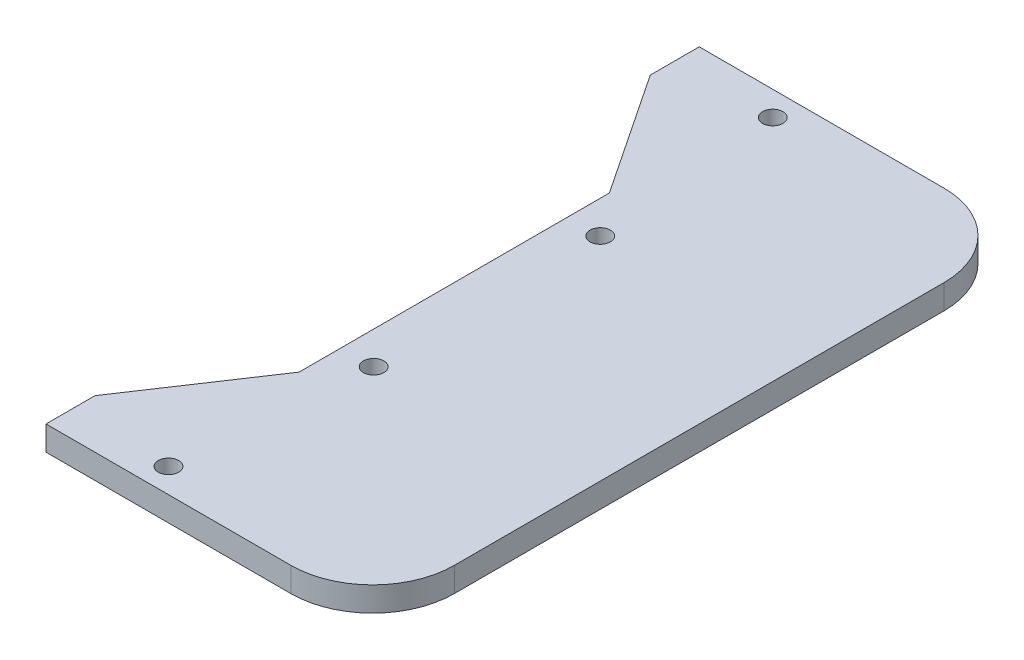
from build123d import *

# Parameters (mm, degrees)
SKETCH1_R           = 1.25
BOSS_EXTRUDE1_DEPTH = 3


with BuildPart() as part:
    # Sketch1 → Boss-Extrude1 (new body)
    with BuildSketch(Plane(origin=(0, 0, 0), x_dir=(1, 0, 0), z_dir=(0, 1, 0))):
        with BuildLine():
            Line((0, 19), (0, -19))
            Line((0, -19), (-10, -34))
            Line((-10, -34), (-10, -40))
            Line((-10, -40), (20, -40))
            ThreePointArc((20, -40), (27.071067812, -37.071067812), (30, -30))
            Line((30, -30), (30, 30))
            ThreePointArc((30, 30), (27.071067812, 37.071067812), (20, 40))
            Line((20, 40), (-10, 40))
            Line((-10, 40), (-10, 34))
            Line((-10, 34), (0, 19))
        make_face()
        with Locations(Location((2, 37, 0), (0, 0, 270))):
            Circle(SKETCH1_R, mode=Mode.SUBTRACT)
        with Locations(Location((4, 13.87, 0), (0, 0, 270))):
            Circle(SKETCH1_R, mode=Mode.SUBTRACT)
        with Locations(Location((2, -37, 0), (0, 0, 90))):
            Circle(SKETCH1_R, mode=Mode.SUBTRACT)
        with Locations(Location((4, -13.87, 0), (0, 0, 90))):
            Circle(SKETCH1_R, mode=Mode.SUBTRACT)
    extrude(amount=BOSS_EXTRUDE1_DEPTH)


solid = part.part
